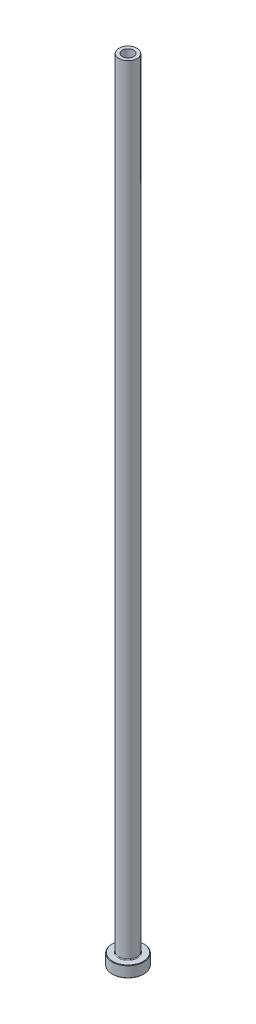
from build123d import *

# Parameters (mm, degrees)
FILLET1_R     = 0.3
CHAMFER1_SIZE = 0.2
CHAMFER3_SIZE = 0.5


with BuildPart() as part:
    # Sketch1 → Revolve1 (revolve)
    with BuildSketch(Plane.XY, mode=Mode.PRIVATE) as revolve1_sk:
        Polygon((-2.5, 350), (-4, 350), (-4, 5), (-7, 5), (-7, 0), (-2.75, 0), (-2.75, 293), (-2.5, 305), align=None)
    revolve(revolve1_sk.sketch.rotate(Axis((0, 92.187680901, 0), (0, -1, 0)), 270), axis=Axis((0, 92.187680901, 0), (0, -1, 0)))

    # Fillet1
    fillet1_edges = [part.edges().sort_by_distance(p)[0] for p in [
        (0, 5, -4),
    ]]
    fillet(fillet1_edges, radius=FILLET1_R)

    # Chamfer1
    chamfer1_edges = [part.edges().sort_by_distance(p)[0] for p in [
        (0, 0, -7),
        (0, 5, -7),
    ]]
    chamfer(chamfer1_edges, length=CHAMFER1_SIZE)

    # Chamfer3
    chamfer3_edges = [part.edges().sort_by_distance(p)[0] for p in [
        (0, 0, -2.75),
    ]]
    chamfer(chamfer3_edges, length=CHAMFER3_SIZE)


solid = part.part
